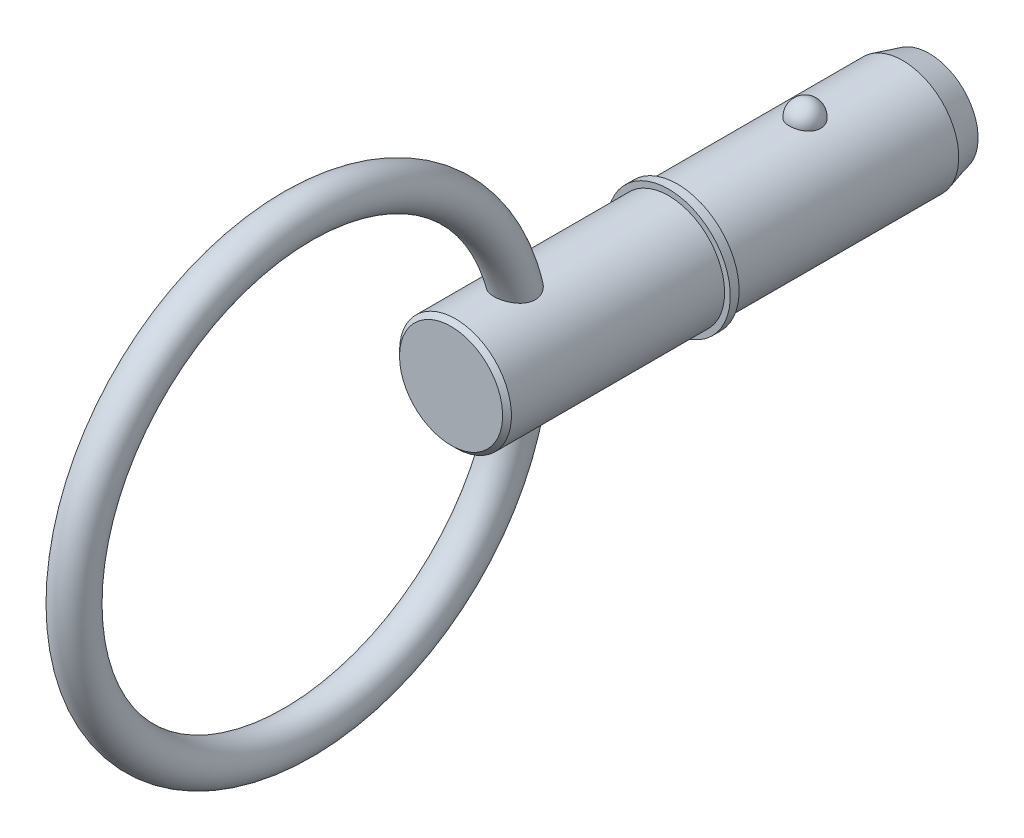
ISO-10303-21;
HEADER;
FILE_DESCRIPTION(('STEP AP214'),'2;1');
FILE_NAME('part.step','',(''),(''),'','','');
FILE_SCHEMA(('AUTOMOTIVE_DESIGN { 1 0 10303 214 1 1 1 1 }'));
ENDSEC;
DATA;
#1=APPLICATION_CONTEXT('core data for automotive mechanical design processes');
#2=APPLICATION_PROTOCOL_DEFINITION('international standard','automotive_design',2000,#1);
#3=PRODUCT_CONTEXT('',#1,'mechanical');
#4=PRODUCT('Part','Part','',(#3));
#5=PRODUCT_RELATED_PRODUCT_CATEGORY('part','',(#4));
#6=PRODUCT_DEFINITION_FORMATION('','',#4);
#7=PRODUCT_DEFINITION_CONTEXT('part definition',#1,'design');
#8=PRODUCT_DEFINITION('design','',#6,#7);
#9=PRODUCT_DEFINITION_SHAPE('','',#8);
#10=(LENGTH_UNIT() NAMED_UNIT(*) SI_UNIT(.MILLI.,.METRE.));
#11=(NAMED_UNIT(*) PLANE_ANGLE_UNIT() SI_UNIT($,.RADIAN.));
#12=(NAMED_UNIT(*) SI_UNIT($,.STERADIAN.) SOLID_ANGLE_UNIT());
#13=UNCERTAINTY_MEASURE_WITH_UNIT(LENGTH_MEASURE(1.E-05),#10,'distance_accuracy_value','');
#14=(GEOMETRIC_REPRESENTATION_CONTEXT(3) GLOBAL_UNCERTAINTY_ASSIGNED_CONTEXT((#13)) GLOBAL_UNIT_ASSIGNED_CONTEXT((#10,
#11,#12)) REPRESENTATION_CONTEXT('',''));
#15=CARTESIAN_POINT('',(0.,0.,0.));
#16=DIRECTION('',(0.,0.,1.));
#17=DIRECTION('',(1.,0.,0.));
#18=AXIS2_PLACEMENT_3D('',#15,#16,#17);
#19=CARTESIAN_POINT('',(0.,0.,12.7));
#20=DIRECTION('',(0.,0.,-1.));
#21=DIRECTION('',(-1.,0.,0.));
#22=AXIS2_PLACEMENT_3D('',#19,#20,#21);
#23=CYLINDRICAL_SURFACE('',#22,6.35);
#24=CARTESIAN_POINT('',(1.76243001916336,6.10051968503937,-1.78));
#25=CARTESIAN_POINT('',(1.76242835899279,6.10052111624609,-1.68050311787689));
#26=CARTESIAN_POINT('',(1.75431593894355,6.1028816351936,-1.58098521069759));
#27=CARTESIAN_POINT('',(1.72206027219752,6.11206037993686,-1.38476972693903));
#28=CARTESIAN_POINT('',(1.69791106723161,6.11888026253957,-1.28807321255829));
#29=CARTESIAN_POINT('',(1.63419596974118,6.13620287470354,-1.10029899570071));
#30=CARTESIAN_POINT('',(1.59463684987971,6.14670398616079,-1.00921884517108));
#31=CARTESIAN_POINT('',(1.50108569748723,6.17021534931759,-0.83516140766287));
#32=CARTESIAN_POINT('',(1.44709398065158,6.18322554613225,-0.752183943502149));
#33=CARTESIAN_POINT('',(1.3257243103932,6.21038081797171,-0.596209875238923));
#34=CARTESIAN_POINT('',(1.2582815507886,6.22453118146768,-0.523264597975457));
#35=CARTESIAN_POINT('',(1.11191624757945,6.25233390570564,-0.389855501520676));
#36=CARTESIAN_POINT('',(1.03299369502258,6.26598626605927,-0.329391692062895));
#37=CARTESIAN_POINT('',(0.866022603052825,6.29123226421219,-0.222793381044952));
#38=CARTESIAN_POINT('',(0.778000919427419,6.30283170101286,-0.1766182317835));
#39=CARTESIAN_POINT('',(0.59510847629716,6.32272058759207,-0.0996905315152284));
#40=CARTESIAN_POINT('',(0.500238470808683,6.33101040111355,-0.068936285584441));
#41=CARTESIAN_POINT('',(0.308164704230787,6.34323464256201,-0.0241595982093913));
#42=CARTESIAN_POINT('',(0.211033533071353,6.34724467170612,-0.00984637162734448));
#43=CARTESIAN_POINT('',(0.0156629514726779,6.3507318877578,0.00262058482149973));
#44=CARTESIAN_POINT('',(-0.0825763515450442,6.35020951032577,0.000775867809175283));
#45=CARTESIAN_POINT('',(-0.275890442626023,6.34473055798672,-0.0188727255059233));
#46=CARTESIAN_POINT('',(-0.370990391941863,6.3398374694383,-0.0364481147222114));
#47=CARTESIAN_POINT('',(-0.556805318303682,6.32622723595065,-0.0867447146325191));
#48=CARTESIAN_POINT('',(-0.64752021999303,6.31751002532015,-0.119466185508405));
#49=CARTESIAN_POINT('',(-0.82260655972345,6.29711353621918,-0.199386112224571));
#50=CARTESIAN_POINT('',(-0.906938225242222,6.28541739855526,-0.246667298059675));
#51=CARTESIAN_POINT('',(-1.06646479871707,6.26032612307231,-0.354365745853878));
#52=CARTESIAN_POINT('',(-1.14165877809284,6.24693081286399,-0.414784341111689));
#53=CARTESIAN_POINT('',(-1.2823514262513,6.21959142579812,-0.548435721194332));
#54=CARTESIAN_POINT('',(-1.34763761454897,6.2056417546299,-0.621891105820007));
#55=CARTESIAN_POINT('',(-1.4651153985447,6.1789624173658,-0.778815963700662));
#56=CARTESIAN_POINT('',(-1.51730606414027,6.16623283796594,-0.862286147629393));
#57=CARTESIAN_POINT('',(-1.60782211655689,6.14325839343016,-1.03799158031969));
#58=CARTESIAN_POINT('',(-1.64598111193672,6.13304379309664,-1.13031660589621));
#59=CARTESIAN_POINT('',(-1.70661885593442,6.11644899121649,-1.32030667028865));
#60=CARTESIAN_POINT('',(-1.72909805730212,6.11006867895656,-1.41797155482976));
#61=CARTESIAN_POINT('',(-1.75775019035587,6.1018881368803,-1.61543246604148));
#62=CARTESIAN_POINT('',(-1.76399136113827,6.10006874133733,-1.71521779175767));
#63=CARTESIAN_POINT('',(-1.76020715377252,6.10116172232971,-1.91445126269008));
#64=CARTESIAN_POINT('',(-1.75018221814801,6.10407397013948,-2.01389941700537));
#65=CARTESIAN_POINT('',(-1.71421005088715,6.11427232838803,-2.20912106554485));
#66=CARTESIAN_POINT('',(-1.68834262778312,6.12153651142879,-2.30491043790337));
#67=CARTESIAN_POINT('',(-1.62139543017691,6.1396067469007,-2.49066180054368));
#68=CARTESIAN_POINT('',(-1.5803150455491,6.15041294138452,-2.58062355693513));
#69=CARTESIAN_POINT('',(-1.48369112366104,6.17443456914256,-2.75271428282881));
#70=CARTESIAN_POINT('',(-1.42806998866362,6.18766281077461,-2.83479789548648));
#71=CARTESIAN_POINT('',(-1.30386620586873,6.21501934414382,-2.98832532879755));
#72=CARTESIAN_POINT('',(-1.23528306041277,6.22914767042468,-3.05976874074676));
#73=CARTESIAN_POINT('',(-1.08663999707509,6.25679135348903,-3.19029656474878));
#74=CARTESIAN_POINT('',(-1.00653826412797,6.27030422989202,-3.24933392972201));
#75=CARTESIAN_POINT('',(-0.837212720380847,6.29514770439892,-3.35304657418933));
#76=CARTESIAN_POINT('',(-0.747989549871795,6.30647845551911,-3.39772286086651));
#77=CARTESIAN_POINT('',(-0.564098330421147,6.32556124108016,-3.47096393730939));
#78=CARTESIAN_POINT('',(-0.469512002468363,6.33335611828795,-3.49972259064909));
#79=CARTESIAN_POINT('',(-0.276633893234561,6.34470628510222,-3.54113722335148));
#80=CARTESIAN_POINT('',(-0.17834256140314,6.34826208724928,-3.55379514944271));
#81=CARTESIAN_POINT('',(0.0171660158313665,6.35071525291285,-3.56255473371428));
#82=CARTESIAN_POINT('',(0.114368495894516,6.34969931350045,-3.55896450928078));
#83=CARTESIAN_POINT('',(0.306746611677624,6.34331695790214,-3.53603383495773));
#84=CARTESIAN_POINT('',(0.401922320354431,6.33795069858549,-3.51669395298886));
#85=CARTESIAN_POINT('',(0.587203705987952,6.32347219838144,-3.4629173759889));
#86=CARTESIAN_POINT('',(0.677327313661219,6.31437430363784,-3.42853846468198));
#87=CARTESIAN_POINT('',(0.850462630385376,6.29339543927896,-3.34564128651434));
#88=CARTESIAN_POINT('',(0.933473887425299,6.2815142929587,-3.29712212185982));
#89=CARTESIAN_POINT('',(1.09144542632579,6.25601750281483,-3.18638742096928));
#90=CARTESIAN_POINT('',(1.16626195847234,6.24237795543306,-3.12397237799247));
#91=CARTESIAN_POINT('',(1.304448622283,6.21497285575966,-2.98755865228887));
#92=CARTESIAN_POINT('',(1.36781676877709,6.20120728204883,-2.91355796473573));
#93=CARTESIAN_POINT('',(1.48252779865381,6.17479923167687,-2.75456133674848));
#94=CARTESIAN_POINT('',(1.53364167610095,6.16218052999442,-2.66939613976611));
#95=CARTESIAN_POINT('',(1.62109397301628,6.13975602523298,-2.49147502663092));
#96=CARTESIAN_POINT('',(1.657437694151,6.12994921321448,-2.39872184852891));
#97=CARTESIAN_POINT('',(1.71127844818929,6.11512175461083,-2.21887622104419));
#98=CARTESIAN_POINT('',(1.73042646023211,6.10968903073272,-2.13230770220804));
#99=CARTESIAN_POINT('',(1.75600284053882,6.10238739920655,-1.95716498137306));
#100=CARTESIAN_POINT('',(1.76243149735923,6.10051841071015,-1.86859082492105));
#101=CARTESIAN_POINT('',(1.76243001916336,6.10051968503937,-1.78));
#102=B_SPLINE_CURVE_WITH_KNOTS('',3,(#24,#25,#26,#27,#28,#29,#30,#31,#32,#33,#34,#35,#36,#37,
#38,#39,#40,#41,#42,#43,#44,#45,#46,#47,#48,#49,#50,#51,#52,#53,#54,#55,#56,#57,#58,#59,#60,#61,
#62,#63,#64,#65,#66,#67,#68,#69,#70,#71,#72,#73,#74,#75,#76,#77,#78,#79,#80,#81,#82,#83,#84,#85,
#86,#87,#88,#89,#90,#91,#92,#93,#94,#95,#96,#97,#98,#99,#100,#101),.UNSPECIFIED.,.T.,.F.,(4,2,2,
2,2,2,2,2,2,2,2,2,2,2,2,2,2,2,2,2,2,2,2,2,2,2,2,2,2,2,2,2,2,2,2,2,2,2,4),(0.,0.298172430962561,
0.596455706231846,0.894608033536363,1.19275383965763,1.49237238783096,1.79199116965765,
2.09074960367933,2.38947519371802,2.68283180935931,2.97616022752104,3.26529599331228,
3.55443672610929,3.84525169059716,4.13609618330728,4.43249276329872,4.72891038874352,
5.02873757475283,5.32855610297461,5.62711261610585,5.92566100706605,6.22271765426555,
6.51978621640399,6.81847366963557,7.11717259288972,7.41698459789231,7.71677557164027,
8.01283014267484,8.30884891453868,8.59927798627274,8.88969658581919,9.17900899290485,
9.46833977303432,9.76212836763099,10.0559678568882,10.3549321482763,10.6537890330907,
10.9192841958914,11.1847733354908),.UNSPECIFIED.);
#103=CARTESIAN_POINT('',(1.76243001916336,6.10051968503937,-1.78));
#104=VERTEX_POINT('',#103);
#105=EDGE_CURVE('E102',#104,#104,#102,.T.);
#106=ORIENTED_EDGE('',*,*,#105,.T.);
#107=EDGE_LOOP('',(#106));
#108=FACE_BOUND('',#107,.T.);
#109=CARTESIAN_POINT('',(0.,0.,-12.88));
#110=DIRECTION('',(0.,0.,-1.));
#111=DIRECTION('',(-1.,0.,0.));
#112=AXIS2_PLACEMENT_3D('',#109,#110,#111);
#113=CIRCLE('',#112,6.35);
#114=CARTESIAN_POINT('',(-6.35,0.,-12.88));
#115=VERTEX_POINT('',#114);
#116=EDGE_CURVE('E109',#115,#115,#113,.F.);
#117=ORIENTED_EDGE('',*,*,#116,.T.);
#118=EDGE_LOOP('',(#117));
#119=FACE_BOUND('',#118,.T.);
#120=CARTESIAN_POINT('',(0.,0.,12.7));
#121=DIRECTION('',(0.,0.,1.));
#122=DIRECTION('',(1.,0.,0.));
#123=AXIS2_PLACEMENT_3D('',#120,#121,#122);
#124=CIRCLE('',#123,6.35);
#125=CARTESIAN_POINT('',(6.35,0.,12.7));
#126=VERTEX_POINT('',#125);
#127=EDGE_CURVE('E107',#126,#126,#124,.T.);
#128=ORIENTED_EDGE('',*,*,#127,.F.);
#129=EDGE_LOOP('',(#128));
#130=FACE_BOUND('',#129,.T.);
#131=ADVANCED_FACE('F39',(#108,#119,#130),#23,.T.);
#132=CARTESIAN_POINT('',(0.,0.,-15.88));
#133=DIRECTION('',(0.,0.,-1.));
#134=DIRECTION('',(-1.,0.,0.));
#135=AXIS2_PLACEMENT_3D('',#132,#133,#134);
#136=PLANE('',#135);
#137=CARTESIAN_POINT('',(0.,0.,-15.88));
#138=DIRECTION('',(0.,0.,-1.));
#139=DIRECTION('',(-1.,0.,0.));
#140=AXIS2_PLACEMENT_3D('',#137,#138,#139);
#141=CIRCLE('',#140,5.54615242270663);
#142=CARTESIAN_POINT('',(-5.54615242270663,0.,-15.88));
#143=VERTEX_POINT('',#142);
#144=EDGE_CURVE('E142',#143,#143,#141,.T.);
#145=ORIENTED_EDGE('',*,*,#144,.T.);
#146=EDGE_LOOP('',(#145));
#147=FACE_BOUND('',#146,.T.);
#148=ADVANCED_FACE('F88',(#147),#136,.T.);
#149=CARTESIAN_POINT('',(0.,0.,-15.88));
#150=DIRECTION('',(0.,0.,1.));
#151=DIRECTION('',(1.,0.,0.));
#152=AXIS2_PLACEMENT_3D('',#149,#150,#151);
#153=CONICAL_SURFACE('',#152,5.54615242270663,0.261799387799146);
#154=ORIENTED_EDGE('',*,*,#116,.F.);
#155=EDGE_LOOP('',(#154));
#156=FACE_BOUND('',#155,.T.);
#157=ORIENTED_EDGE('',*,*,#144,.F.);
#158=EDGE_LOOP('',(#157));
#159=FACE_BOUND('',#158,.T.);
#160=ADVANCED_FACE('F94',(#156,#159),#153,.T.);
#161=CARTESIAN_POINT('',(0.,6.35,-1.78));
#162=DIRECTION('',(0.,1.,0.));
#163=DIRECTION('',(0.,0.,-1.));
#164=AXIS2_PLACEMENT_3D('',#161,#162,#163);
#165=SPHERICAL_SURFACE('',#164,1.78);
#166=ORIENTED_EDGE('',*,*,#105,.F.);
#167=EDGE_LOOP('',(#166));
#168=FACE_BOUND('',#167,.T.);
#169=ADVANCED_FACE('F112',(#168),#165,.T.);
#170=CARTESIAN_POINT('',(0.,0.,12.7));
#171=DIRECTION('',(0.,0.,-1.));
#172=DIRECTION('',(-1.,0.,0.));
#173=AXIS2_PLACEMENT_3D('',#170,#171,#172);
#174=PLANE('',#173);
#175=ORIENTED_EDGE('',*,*,#127,.T.);
#176=EDGE_LOOP('',(#175));
#177=FACE_BOUND('',#176,.T.);
#178=CARTESIAN_POINT('',(0.,0.,12.7));
#179=DIRECTION('',(0.,0.,-1.));
#180=DIRECTION('',(-1.,0.,0.));
#181=AXIS2_PLACEMENT_3D('',#178,#179,#180);
#182=CIRCLE('',#181,7.);
#183=CARTESIAN_POINT('',(-7.,0.,12.7));
#184=VERTEX_POINT('',#183);
#185=EDGE_CURVE('E108',#184,#184,#182,.T.);
#186=ORIENTED_EDGE('',*,*,#185,.T.);
#187=EDGE_LOOP('',(#186));
#188=FACE_BOUND('',#187,.T.);
#189=ADVANCED_FACE('F116',(#177,#188),#174,.T.);
#190=CARTESIAN_POINT('',(0.,0.,33.7287874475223));
#191=DIRECTION('',(0.,0.,-1.));
#192=DIRECTION('',(-1.,0.,0.));
#193=AXIS2_PLACEMENT_3D('',#190,#191,#192);
#194=CYLINDRICAL_SURFACE('',#193,7.);
#195=CARTESIAN_POINT('',(0.,0.,13.7));
#196=DIRECTION('',(0.,0.,-1.));
#197=DIRECTION('',(-1.,0.,0.));
#198=AXIS2_PLACEMENT_3D('',#195,#196,#197);
#199=CIRCLE('',#198,7.);
#200=CARTESIAN_POINT('',(-7.,0.,13.7));
#201=VERTEX_POINT('',#200);
#202=EDGE_CURVE('E133',#201,#201,#199,.T.);
#203=ORIENTED_EDGE('',*,*,#202,.T.);
#204=EDGE_LOOP('',(#203));
#205=FACE_BOUND('',#204,.T.);
#206=ORIENTED_EDGE('',*,*,#185,.F.);
#207=EDGE_LOOP('',(#206));
#208=FACE_BOUND('',#207,.T.);
#209=ADVANCED_FACE('F120',(#205,#208),#194,.T.);
#210=CARTESIAN_POINT('',(0.,7.,13.7));
#211=DIRECTION('',(0.,0.,1.));
#212=DIRECTION('',(1.,0.,0.));
#213=AXIS2_PLACEMENT_3D('',#210,#211,#212);
#214=PLANE('',#213);
#215=CARTESIAN_POINT('',(0.,0.,13.7));
#216=DIRECTION('',(0.,0.,1.));
#217=DIRECTION('',(1.,0.,0.));
#218=AXIS2_PLACEMENT_3D('',#215,#216,#217);
#219=CIRCLE('',#218,6.35);
#220=CARTESIAN_POINT('',(6.35,0.,13.7));
#221=VERTEX_POINT('',#220);
#222=EDGE_CURVE('E111',#221,#221,#219,.T.);
#223=ORIENTED_EDGE('',*,*,#222,.F.);
#224=EDGE_LOOP('',(#223));
#225=FACE_BOUND('',#224,.T.);
#226=ORIENTED_EDGE('',*,*,#202,.F.);
#227=EDGE_LOOP('',(#226));
#228=FACE_BOUND('',#227,.T.);
#229=ADVANCED_FACE('F85',(#225,#228),#214,.T.);
#230=CARTESIAN_POINT('',(0.,0.,38.4));
#231=DIRECTION('',(0.,0.,-1.));
#232=DIRECTION('',(-1.,0.,0.));
#233=AXIS2_PLACEMENT_3D('',#230,#231,#232);
#234=CYLINDRICAL_SURFACE('',#233,6.35);
#235=CARTESIAN_POINT('',(-1.08120660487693,-6.25727514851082,29.1515811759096));
#236=CARTESIAN_POINT('',(-0.970724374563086,-6.27636409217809,29.0938798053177));
#237=CARTESIAN_POINT('',(-0.855136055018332,-6.29329984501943,29.0452195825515));
#238=CARTESIAN_POINT('',(-0.6169586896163,-6.32109419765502,28.9670559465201));
#239=CARTESIAN_POINT('',(-0.494369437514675,-6.3319526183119,28.9375530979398));
#240=CARTESIAN_POINT('',(-0.245606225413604,-6.34647141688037,28.8983673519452));
#241=CARTESIAN_POINT('',(-0.119431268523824,-6.35012977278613,28.8886900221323));
#242=CARTESIAN_POINT('',(0.1328495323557,-6.34986313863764,28.8894002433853));
#243=CARTESIAN_POINT('',(0.258955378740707,-6.34593843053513,28.8997870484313));
#244=CARTESIAN_POINT('',(0.506912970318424,-6.33094785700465,28.9402854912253));
#245=CARTESIAN_POINT('',(0.628781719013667,-6.31991516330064,28.9703055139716));
#246=CARTESIAN_POINT('',(0.86548692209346,-6.29187143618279,29.0493088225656));
#247=CARTESIAN_POINT('',(0.980322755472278,-6.27485987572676,29.098293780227));
#248=CARTESIAN_POINT('',(1.20050616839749,-6.23649440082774,29.2145408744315));
#249=CARTESIAN_POINT('',(1.30578867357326,-6.21511352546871,29.2819174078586));
#250=CARTESIAN_POINT('',(1.50311440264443,-6.17036440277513,29.4333596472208));
#251=CARTESIAN_POINT('',(1.59515714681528,-6.14699608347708,29.5174259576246));
#252=CARTESIAN_POINT('',(1.76326863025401,-6.10090072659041,29.7002474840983));
#253=CARTESIAN_POINT('',(1.83935482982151,-6.07817301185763,29.7989864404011));
#254=CARTESIAN_POINT('',(1.97338559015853,-6.03599268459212,30.008703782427));
#255=CARTESIAN_POINT('',(2.03133638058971,-6.01653894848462,30.1196779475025));
#256=CARTESIAN_POINT('',(2.1259120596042,-5.98376466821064,30.347018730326));
#257=CARTESIAN_POINT('',(2.16315310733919,-5.97026970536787,30.4631040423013));
#258=CARTESIAN_POINT('',(2.21830650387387,-5.94999923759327,30.7003187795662));
#259=CARTESIAN_POINT('',(2.2362211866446,-5.94322292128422,30.8214475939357));
#260=CARTESIAN_POINT('',(2.25273772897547,-5.93698111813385,31.0632812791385));
#261=CARTESIAN_POINT('',(2.25163224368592,-5.93740484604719,31.1839640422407));
#262=CARTESIAN_POINT('',(2.23167546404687,-5.94493297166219,31.4236203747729));
#263=CARTESIAN_POINT('',(2.21281883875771,-5.9520393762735,31.5425934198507));
#264=CARTESIAN_POINT('',(2.15679576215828,-5.97257680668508,31.783836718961));
#265=CARTESIAN_POINT('',(2.11851138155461,-5.98639144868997,31.9058128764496));
#266=CARTESIAN_POINT('',(2.02470263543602,-6.01876484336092,32.1422848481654));
#267=CARTESIAN_POINT('',(1.96916879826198,-6.03732620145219,32.2567765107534));
#268=CARTESIAN_POINT('',(1.83526629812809,-6.07945247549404,32.4879958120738));
#269=CARTESIAN_POINT('',(1.75507038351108,-6.10334207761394,32.6036110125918));
#270=CARTESIAN_POINT('',(1.57657889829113,-6.1518655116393,32.8198949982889));
#271=CARTESIAN_POINT('',(1.47827192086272,-6.17649980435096,32.9205542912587));
#272=CARTESIAN_POINT('',(1.26306696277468,-6.22410762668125,33.1050235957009));
#273=CARTESIAN_POINT('',(1.14585214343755,-6.24704086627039,33.1884783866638));
#274=CARTESIAN_POINT('',(0.896825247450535,-6.28760987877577,33.331400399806));
#275=CARTESIAN_POINT('',(0.765036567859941,-6.30525397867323,33.3909053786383));
#276=CARTESIAN_POINT('',(0.50945479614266,-6.330648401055,33.4752631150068));
#277=CARTESIAN_POINT('',(0.386964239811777,-6.33940909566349,33.5036959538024));
#278=CARTESIAN_POINT('',(0.200813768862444,-6.3471308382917,33.5286800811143));
#279=CARTESIAN_POINT('',(0.138353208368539,-6.34880140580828,33.534063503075));
#280=CARTESIAN_POINT('',(0.0131841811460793,-6.35029448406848,33.5388738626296));
#281=CARTESIAN_POINT('',(-0.0495242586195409,-6.35011719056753,33.5383014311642));
#282=CARTESIAN_POINT('',(-0.219860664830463,-6.34710452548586,33.5285979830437));
#283=CARTESIAN_POINT('',(-0.327176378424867,-6.34243953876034,33.5135767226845));
#284=CARTESIAN_POINT('',(-0.537619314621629,-6.32808248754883,33.4666735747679));
#285=CARTESIAN_POINT('',(-0.640746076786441,-6.31838987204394,33.4347898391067));
#286=CARTESIAN_POINT('',(-0.841795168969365,-6.29478075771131,33.3553379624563));
#287=CARTESIAN_POINT('',(-0.939631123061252,-6.28081033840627,33.30756888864));
#288=CARTESIAN_POINT('',(-1.12690564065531,-6.2499288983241,33.1985138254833));
#289=CARTESIAN_POINT('',(-1.21634109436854,-6.2330167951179,33.137222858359));
#290=CARTESIAN_POINT('',(-1.3971303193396,-6.19517308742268,32.9940397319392));
#291=CARTESIAN_POINT('',(-1.48711596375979,-6.17400700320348,32.9104839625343));
#292=CARTESIAN_POINT('',(-1.65373642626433,-6.13148145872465,32.7309968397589));
#293=CARTESIAN_POINT('',(-1.73036130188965,-6.11012186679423,32.6350563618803));
#294=CARTESIAN_POINT('',(-1.87908981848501,-6.06616529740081,32.4186208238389));
#295=CARTESIAN_POINT('',(-1.94902044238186,-6.04382072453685,32.2965721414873));
#296=CARTESIAN_POINT('',(-2.06849605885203,-6.00398244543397,32.042070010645));
#297=CARTESIAN_POINT('',(-2.11803457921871,-5.98649027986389,31.9096132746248));
#298=CARTESIAN_POINT('',(-2.19551930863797,-5.95851933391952,31.6345936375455));
#299=CARTESIAN_POINT('',(-2.22297667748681,-5.94819998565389,31.4918743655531));
#300=CARTESIAN_POINT('',(-2.25222139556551,-5.93719450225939,31.2034800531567));
#301=CARTESIAN_POINT('',(-2.25403508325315,-5.93649848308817,31.0578081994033));
#302=CARTESIAN_POINT('',(-2.23178480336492,-5.94489150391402,30.7838044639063));
#303=CARTESIAN_POINT('',(-2.21035650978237,-5.95298402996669,30.6552268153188));
#304=CARTESIAN_POINT('',(-2.14565882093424,-5.97660650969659,30.4044089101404));
#305=CARTESIAN_POINT('',(-2.10239634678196,-5.99213410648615,30.2821666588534));
#306=CARTESIAN_POINT('',(-1.99913159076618,-6.02732890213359,30.0567478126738));
#307=CARTESIAN_POINT('',(-1.94060271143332,-6.04660536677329,29.9528298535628));
#308=CARTESIAN_POINT('',(-1.80736340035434,-6.0877569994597,29.756534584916));
#309=CARTESIAN_POINT('',(-1.73265259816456,-6.10963222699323,29.6641575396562));
#310=CARTESIAN_POINT('',(-1.56865095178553,-6.15378470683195,29.4926034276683));
#311=CARTESIAN_POINT('',(-1.47928749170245,-6.17606344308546,29.4134962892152));
#312=CARTESIAN_POINT('',(-1.28858731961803,-6.21864788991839,29.2706753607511));
#313=CARTESIAN_POINT('',(-1.18724893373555,-6.23895332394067,29.2069637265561));
#314=CARTESIAN_POINT('',(-1.08120660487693,-6.25727514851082,29.1515811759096));
#315=B_SPLINE_CURVE_WITH_KNOTS('',3,(#235,#236,#237,#238,#239,#240,#241,#242,#243,#244,#245,
#246,#247,#248,#249,#250,#251,#252,#253,#254,#255,#256,#257,#258,#259,#260,#261,#262,#263,#264,
#265,#266,#267,#268,#269,#270,#271,#272,#273,#274,#275,#276,#277,#278,#279,#280,#281,#282,#283,
#284,#285,#286,#287,#288,#289,#290,#291,#292,#293,#294,#295,#296,#297,#298,#299,#300,#301,#302,
#303,#304,#305,#306,#307,#308,#309,#310,#311,#312,#313,#314),.UNSPECIFIED.,.T.,.F.,(4,2,2,2,2,2,
2,2,2,2,2,2,2,2,2,2,2,2,2,2,2,2,2,2,2,2,2,2,2,2,2,2,2,2,2,2,2,2,2,4),(0.,0.377861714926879,
0.755734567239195,1.13371352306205,1.51167842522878,1.88789208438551,2.26413891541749,
2.64278156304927,3.02143792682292,3.39967776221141,3.77778752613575,4.14394628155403,
4.51006081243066,4.87054720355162,5.23114188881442,5.61534494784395,5.99975934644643,
6.42600522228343,6.85252048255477,7.28711365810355,7.721018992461,8.0966613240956,
8.28452949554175,8.47237776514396,8.79607953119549,9.11981678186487,9.44781545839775,
9.77593508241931,10.1483085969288,10.5209580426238,10.9463240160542,11.3718248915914,
11.8065046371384,12.2407378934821,12.6304236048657,13.0199858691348,13.3807583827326,
13.7415391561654,14.104165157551,14.4668419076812),.UNSPECIFIED.);
#316=CARTESIAN_POINT('',(-1.08120660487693,-6.25727514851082,29.1515811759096));
#317=VERTEX_POINT('',#316);
#318=EDGE_CURVE('E10',#317,#317,#315,.T.);
#319=ORIENTED_EDGE('',*,*,#318,.F.);
#320=EDGE_LOOP('',(#319));
#321=FACE_BOUND('',#320,.T.);
#322=CARTESIAN_POINT('',(-1.08120660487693,6.25727514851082,29.1515811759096));
#323=CARTESIAN_POINT('',(-1.19093168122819,6.23831652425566,29.208887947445));
#324=CARTESIAN_POINT('',(-1.29562751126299,6.21723224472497,29.2751167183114));
#325=CARTESIAN_POINT('',(-1.49211272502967,6.17302620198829,29.424020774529));
#326=CARTESIAN_POINT('',(-1.58390200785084,6.14990442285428,29.5066961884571));
#327=CARTESIAN_POINT('',(-1.75209695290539,6.10411985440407,29.6867778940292));
#328=CARTESIAN_POINT('',(-1.82848346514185,6.08145766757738,29.7842022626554));
#329=CARTESIAN_POINT('',(-1.96346259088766,6.0392331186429,29.9912733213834));
#330=CARTESIAN_POINT('',(-2.02206050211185,6.01966983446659,30.1009163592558));
#331=CARTESIAN_POINT('',(-2.11860444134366,5.9863659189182,30.3265649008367));
#332=CARTESIAN_POINT('',(-2.15701637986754,5.97249571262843,30.4423519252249));
#333=CARTESIAN_POINT('',(-2.21449304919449,5.95142584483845,30.6791911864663));
#334=CARTESIAN_POINT('',(-2.23356015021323,5.94422536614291,30.8002427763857));
#335=CARTESIAN_POINT('',(-2.25228141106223,5.93715610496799,31.0419445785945));
#336=CARTESIAN_POINT('',(-2.2522578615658,5.93716560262,31.1625670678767));
#337=CARTESIAN_POINT('',(-2.2344206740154,5.94389982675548,31.4022777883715));
#338=CARTESIAN_POINT('',(-2.21660184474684,5.95062651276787,31.5213655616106));
#339=CARTESIAN_POINT('',(-2.16272689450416,5.97042554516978,31.7627056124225));
#340=CARTESIAN_POINT('',(-2.12559286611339,5.98387086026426,31.8846848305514));
#341=CARTESIAN_POINT('',(-2.03409944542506,6.0155857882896,32.121342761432));
#342=CARTESIAN_POINT('',(-1.97973080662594,6.03385799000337,32.2360175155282));
#343=CARTESIAN_POINT('',(-1.84828023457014,6.07549301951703,32.4678654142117));
#344=CARTESIAN_POINT('',(-1.76936622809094,6.09919386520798,32.5839437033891));
#345=CARTESIAN_POINT('',(-1.59344783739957,6.14749881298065,32.8014208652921));
#346=CARTESIAN_POINT('',(-1.49643151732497,6.17210350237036,32.9028099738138));
#347=CARTESIAN_POINT('',(-1.28333318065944,6.21994692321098,33.0895083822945));
#348=CARTESIAN_POINT('',(-1.1668572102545,6.24314005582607,33.1743845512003));
#349=CARTESIAN_POINT('',(-0.919062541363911,6.2843871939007,33.3203440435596));
#350=CARTESIAN_POINT('',(-0.787766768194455,6.30244898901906,33.3814634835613));
#351=CARTESIAN_POINT('',(-0.532335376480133,6.32876911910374,33.4691112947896));
#352=CARTESIAN_POINT('',(-0.409516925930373,6.33800211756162,33.4991235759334));
#353=CARTESIAN_POINT('',(-0.222636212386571,6.34640533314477,33.5263386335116));
#354=CARTESIAN_POINT('',(-0.159893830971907,6.34829860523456,33.5324428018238));
#355=CARTESIAN_POINT('',(-0.0340877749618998,6.35021985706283,33.5386341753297));
#356=CARTESIAN_POINT('',(0.0289758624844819,6.35024804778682,33.5387220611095));
#357=CARTESIAN_POINT('',(0.200008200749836,6.34776620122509,33.5307320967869));
#358=CARTESIAN_POINT('',(0.307730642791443,6.34342046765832,33.5167500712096));
#359=CARTESIAN_POINT('',(0.519134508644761,6.32963338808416,33.4717653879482));
#360=CARTESIAN_POINT('',(0.622815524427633,6.3201915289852,33.4407610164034));
#361=CARTESIAN_POINT('',(0.82458088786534,6.2970603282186,33.3630869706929));
#362=CARTESIAN_POINT('',(0.922611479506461,6.28333629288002,33.3162890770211));
#363=CARTESIAN_POINT('',(1.11039970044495,6.2528858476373,33.2091226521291));
#364=CARTESIAN_POINT('',(1.20015435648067,6.23615836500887,33.1487492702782));
#365=CARTESIAN_POINT('',(1.38155818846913,6.19866747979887,33.0076024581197));
#366=CARTESIAN_POINT('',(1.47187645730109,6.17766310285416,32.9251847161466));
#367=CARTESIAN_POINT('',(1.63933626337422,6.13535258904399,32.7479469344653));
#368=CARTESIAN_POINT('',(1.71646809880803,6.11404624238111,32.6531178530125));
#369=CARTESIAN_POINT('',(1.86660460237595,6.07002946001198,32.438851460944));
#370=CARTESIAN_POINT('',(1.93743710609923,6.04755477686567,32.3178347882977));
#371=CARTESIAN_POINT('',(2.05894300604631,6.00727604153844,32.0652808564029));
#372=CARTESIAN_POINT('',(2.10960917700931,5.98947366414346,31.9337398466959));
#373=CARTESIAN_POINT('',(2.18982014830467,5.96062717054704,31.6597589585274));
#374=CARTESIAN_POINT('',(2.21877575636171,5.94977267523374,31.5171236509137));
#375=CARTESIAN_POINT('',(2.2510475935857,5.93764416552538,31.2285958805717));
#376=CARTESIAN_POINT('',(2.25438985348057,5.93636042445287,31.0827068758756));
#377=CARTESIAN_POINT('',(2.23498011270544,5.94368858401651,30.8077311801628));
#378=CARTESIAN_POINT('',(2.21482640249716,5.95131530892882,30.6784341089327));
#379=CARTESIAN_POINT('',(2.15248760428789,5.97414352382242,30.4259695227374));
#380=CARTESIAN_POINT('',(2.11031020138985,5.98934237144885,30.3027998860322));
#381=CARTESIAN_POINT('',(2.00904610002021,6.02402214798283,30.0757832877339));
#382=CARTESIAN_POINT('',(1.95150192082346,6.04308594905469,29.9711789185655));
#383=CARTESIAN_POINT('',(1.82009972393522,6.08395083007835,29.7733823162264));
#384=CARTESIAN_POINT('',(1.74624088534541,6.10575204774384,29.6801906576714));
#385=CARTESIAN_POINT('',(1.58309476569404,6.15008431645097,29.5061646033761));
#386=CARTESIAN_POINT('',(1.49360904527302,6.17262128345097,29.4255180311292));
#387=CARTESIAN_POINT('',(1.30231515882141,6.21579297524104,29.2798366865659));
#388=CARTESIAN_POINT('',(1.20050521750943,6.23642742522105,29.2148041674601));
#389=CARTESIAN_POINT('',(0.983786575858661,6.27432316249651,29.0998596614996));
#390=CARTESIAN_POINT('',(0.868563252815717,6.29145558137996,29.0504972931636));
#391=CARTESIAN_POINT('',(0.630994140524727,6.31970327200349,28.9708857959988));
#392=CARTESIAN_POINT('',(0.508648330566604,6.33081852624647,28.9406367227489));
#393=CARTESIAN_POINT('',(0.259933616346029,6.34590352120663,28.8998795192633));
#394=CARTESIAN_POINT('',(0.133554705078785,6.34985380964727,28.8894251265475));
#395=CARTESIAN_POINT('',(-0.119270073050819,6.35013815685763,28.8886676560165));
#396=CARTESIAN_POINT('',(-0.245715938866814,6.34647233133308,28.8983642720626));
#397=CARTESIAN_POINT('',(-0.494670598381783,6.33192772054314,28.9376209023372));
#398=CARTESIAN_POINT('',(-0.617189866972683,6.3210701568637,28.9671224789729));
#399=CARTESIAN_POINT('',(-0.855240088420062,6.29328476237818,29.0452630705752));
#400=CARTESIAN_POINT('',(-0.970770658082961,6.27635659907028,29.0939031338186));
#401=CARTESIAN_POINT('',(-1.08120660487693,6.25727514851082,29.1515811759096));
#402=B_SPLINE_CURVE_WITH_KNOTS('',3,(#322,#323,#324,#325,#326,#327,#328,#329,#330,#331,#332,
#333,#334,#335,#336,#337,#338,#339,#340,#341,#342,#343,#344,#345,#346,#347,#348,#349,#350,#351,
#352,#353,#354,#355,#356,#357,#358,#359,#360,#361,#362,#363,#364,#365,#366,#367,#368,#369,#370,
#371,#372,#373,#374,#375,#376,#377,#378,#379,#380,#381,#382,#383,#384,#385,#386,#387,#388,#389,
#390,#391,#392,#393,#394,#395,#396,#397,#398,#399,#400,#401),.UNSPECIFIED.,.T.,.F.,(4,2,2,2,2,2,
2,2,2,2,2,2,2,2,2,2,2,2,2,2,2,2,2,2,2,2,2,2,2,2,2,2,2,2,2,2,2,2,2,4),(0.,0.3752589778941,
0.750520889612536,1.12624651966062,1.50186014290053,1.86837438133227,2.23484370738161,
2.59512638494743,2.95551419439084,3.33859924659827,3.72189017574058,4.14704029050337,
4.57247172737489,5.00788576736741,5.44263524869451,5.82040093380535,6.00932292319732,
6.19822354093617,6.52266071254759,6.84713055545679,7.17430063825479,7.50158780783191,
7.87233275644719,8.24334931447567,8.66748794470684,9.09177840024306,9.52720369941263,
9.96218641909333,10.3532895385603,10.7442562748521,11.1052784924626,11.4663188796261,
11.8323306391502,12.1983951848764,12.5761580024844,12.9539219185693,13.3327099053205,
13.7114921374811,14.0891615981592,14.4668517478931),.UNSPECIFIED.);
#403=CARTESIAN_POINT('',(-1.08120660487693,6.25727514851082,29.1515811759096));
#404=VERTEX_POINT('',#403);
#405=EDGE_CURVE('E51',#404,#404,#402,.T.);
#406=ORIENTED_EDGE('',*,*,#405,.F.);
#407=EDGE_LOOP('',(#406));
#408=FACE_BOUND('',#407,.T.);
#409=CARTESIAN_POINT('',(0.,0.,37.9));
#410=DIRECTION('',(0.,0.,-1.));
#411=DIRECTION('',(-1.,0.,0.));
#412=AXIS2_PLACEMENT_3D('',#409,#410,#411);
#413=CIRCLE('',#412,6.35);
#414=CARTESIAN_POINT('',(-6.35,0.,37.9));
#415=VERTEX_POINT('',#414);
#416=EDGE_CURVE('E64',#415,#415,#413,.T.);
#417=ORIENTED_EDGE('',*,*,#416,.T.);
#418=EDGE_LOOP('',(#417));
#419=FACE_BOUND('',#418,.T.);
#420=ORIENTED_EDGE('',*,*,#222,.T.);
#421=EDGE_LOOP('',(#420));
#422=FACE_BOUND('',#421,.T.);
#423=ADVANCED_FACE('F69',(#321,#408,#419,#422),#234,.T.);
#424=CARTESIAN_POINT('',(0.,0.,38.4));
#425=DIRECTION('',(0.,0.,-1.));
#426=DIRECTION('',(-1.,0.,0.));
#427=AXIS2_PLACEMENT_3D('',#424,#425,#426);
#428=PLANE('',#427);
#429=CARTESIAN_POINT('',(0.,0.,38.4));
#430=DIRECTION('',(0.,0.,-1.));
#431=DIRECTION('',(-1.,0.,0.));
#432=AXIS2_PLACEMENT_3D('',#429,#430,#431);
#433=CIRCLE('',#432,5.84999999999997);
#434=CARTESIAN_POINT('',(-5.84999999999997,0.,38.4));
#435=VERTEX_POINT('',#434);
#436=EDGE_CURVE('E58',#435,#435,#433,.F.);
#437=ORIENTED_EDGE('',*,*,#436,.T.);
#438=EDGE_LOOP('',(#437));
#439=FACE_BOUND('',#438,.T.);
#440=ADVANCED_FACE('F76',(#439),#428,.F.);
#441=CARTESIAN_POINT('',(0.,0.,37.9));
#442=DIRECTION('',(0.,0.,-1.));
#443=DIRECTION('',(-1.,0.,0.));
#444=AXIS2_PLACEMENT_3D('',#441,#442,#443);
#445=CONICAL_SURFACE('',#444,6.35,0.785398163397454);
#446=ORIENTED_EDGE('',*,*,#436,.F.);
#447=EDGE_LOOP('',(#446));
#448=FACE_BOUND('',#447,.T.);
#449=ORIENTED_EDGE('',*,*,#416,.F.);
#450=EDGE_LOOP('',(#449));
#451=FACE_BOUND('',#450,.T.);
#452=ADVANCED_FACE('F41',(#448,#451),#445,.T.);
#453=CARTESIAN_POINT('',(0.,0.,55.8));
#454=DIRECTION('',(1.,0.,0.));
#455=DIRECTION('',(0.,0.,-1.));
#456=AXIS2_PLACEMENT_3D('',#453,#454,#455);
#457=TOROIDAL_SURFACE('',#456,25.4,2.25);
#458=ORIENTED_EDGE('',*,*,#318,.T.);
#459=EDGE_LOOP('',(#458));
#460=FACE_BOUND('',#459,.T.);
#461=ORIENTED_EDGE('',*,*,#405,.T.);
#462=EDGE_LOOP('',(#461));
#463=FACE_BOUND('',#462,.T.);
#464=ADVANCED_FACE('F73',(#460,#463),#457,.T.);
#465=CLOSED_SHELL('',(#131,#148,#160,#169,#189,#209,#229,#423,#440,#452,#464));
#466=MANIFOLD_SOLID_BREP('B2',#465);
#467=ADVANCED_BREP_SHAPE_REPRESENTATION('',(#18,#466),#14);
#468=SHAPE_DEFINITION_REPRESENTATION(#9,#467);
ENDSEC;
END-ISO-10303-21;
